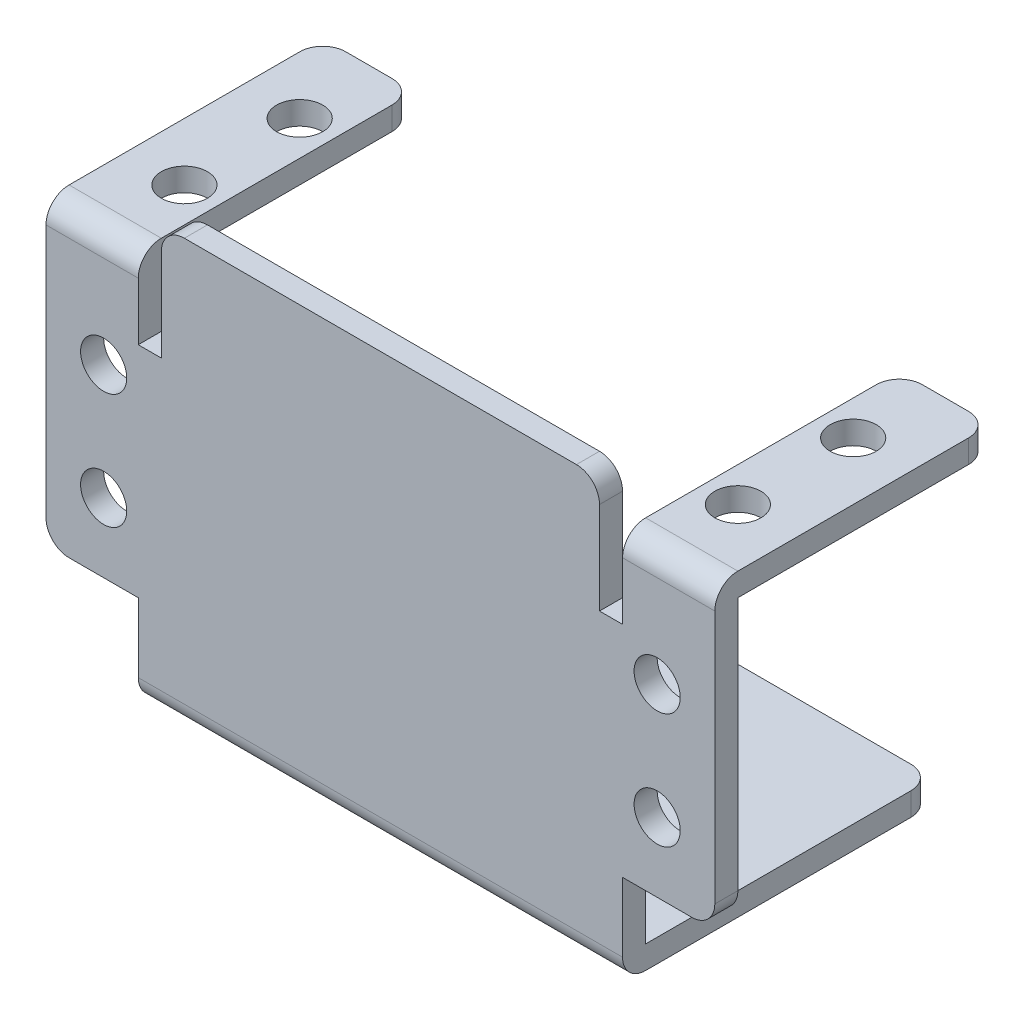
ISO-10303-21;
HEADER;
FILE_DESCRIPTION(('STEP AP214'),'2;1');
FILE_NAME('part.step','',(''),(''),'','','');
FILE_SCHEMA(('AUTOMOTIVE_DESIGN { 1 0 10303 214 1 1 1 1 }'));
ENDSEC;
DATA;
#1=APPLICATION_CONTEXT('core data for automotive mechanical design processes');
#2=APPLICATION_PROTOCOL_DEFINITION('international standard','automotive_design',2000,#1);
#3=PRODUCT_CONTEXT('',#1,'mechanical');
#4=PRODUCT('Part','Part','',(#3));
#5=PRODUCT_RELATED_PRODUCT_CATEGORY('part','',(#4));
#6=PRODUCT_DEFINITION_FORMATION('','',#4);
#7=PRODUCT_DEFINITION_CONTEXT('part definition',#1,'design');
#8=PRODUCT_DEFINITION('design','',#6,#7);
#9=PRODUCT_DEFINITION_SHAPE('','',#8);
#10=(LENGTH_UNIT() NAMED_UNIT(*) SI_UNIT(.MILLI.,.METRE.));
#11=(NAMED_UNIT(*) PLANE_ANGLE_UNIT() SI_UNIT($,.RADIAN.));
#12=(NAMED_UNIT(*) SI_UNIT($,.STERADIAN.) SOLID_ANGLE_UNIT());
#13=UNCERTAINTY_MEASURE_WITH_UNIT(LENGTH_MEASURE(1.E-05),#10,'distance_accuracy_value','');
#14=(GEOMETRIC_REPRESENTATION_CONTEXT(3) GLOBAL_UNCERTAINTY_ASSIGNED_CONTEXT((#13)) GLOBAL_UNIT_ASSIGNED_CONTEXT((#10,
#11,#12)) REPRESENTATION_CONTEXT('',''));
#15=CARTESIAN_POINT('',(0.,0.,0.));
#16=DIRECTION('',(0.,0.,1.));
#17=DIRECTION('',(1.,0.,0.));
#18=AXIS2_PLACEMENT_3D('',#15,#16,#17);
#19=CARTESIAN_POINT('',(-65.2513428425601,2.,-34.1860296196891));
#20=DIRECTION('',(1.,0.,0.));
#21=DIRECTION('',(0.,0.,-1.));
#22=AXIS2_PLACEMENT_3D('',#19,#20,#21);
#23=PLANE('',#22);
#24=DIRECTION('',(0.,0.,1.));
#25=VECTOR('',#24,1.);
#26=CARTESIAN_POINT('',(-65.2513428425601,2.,-34.1860296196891));
#27=LINE('',#26,#25);
#28=CARTESIAN_POINT('',(-65.2513428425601,2.,-32.1860296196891));
#29=VERTEX_POINT('',#28);
#30=CARTESIAN_POINT('',(-65.2513428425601,2.,-9.18602961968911));
#31=VERTEX_POINT('',#30);
#32=EDGE_CURVE('E341',#29,#31,#27,.T.);
#33=ORIENTED_EDGE('',*,*,#32,.F.);
#34=DIRECTION('',(0.,-1.,0.));
#35=VECTOR('',#34,1.);
#36=CARTESIAN_POINT('',(-65.2513428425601,2.,-32.1860296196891));
#37=LINE('',#36,#35);
#38=CARTESIAN_POINT('',(-65.2513428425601,0.,-32.1860296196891));
#39=VERTEX_POINT('',#38);
#40=EDGE_CURVE('E414',#29,#39,#37,.T.);
#41=ORIENTED_EDGE('',*,*,#40,.T.);
#42=DIRECTION('',(0.,0.,1.));
#43=VECTOR('',#42,1.);
#44=CARTESIAN_POINT('',(-65.2513428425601,0.,-34.1860296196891));
#45=LINE('',#44,#43);
#46=CARTESIAN_POINT('',(-65.2513428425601,0.,-9.18602961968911));
#47=VERTEX_POINT('',#46);
#48=EDGE_CURVE('E340',#39,#47,#45,.T.);
#49=ORIENTED_EDGE('',*,*,#48,.T.);
#50=CARTESIAN_POINT('',(-65.2513428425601,2.,-9.18602961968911));
#51=DIRECTION('',(1.,0.,0.));
#52=DIRECTION('',(0.,0.,-1.));
#53=AXIS2_PLACEMENT_3D('',#50,#51,#52);
#54=CIRCLE('',#53,2.);
#55=CARTESIAN_POINT('',(-65.2513428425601,2.,-7.18602961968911));
#56=VERTEX_POINT('',#55);
#57=EDGE_CURVE('E412',#47,#56,#54,.F.);
#58=ORIENTED_EDGE('',*,*,#57,.T.);
#59=DIRECTION('',(0.,-1.,0.));
#60=VECTOR('',#59,1.);
#61=CARTESIAN_POINT('',(-65.2513428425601,0.,-7.18602961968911));
#62=LINE('',#61,#60);
#63=CARTESIAN_POINT('',(-65.2513428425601,8.,-7.18602961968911));
#64=VERTEX_POINT('',#63);
#65=EDGE_CURVE('E326',#64,#56,#62,.T.);
#66=ORIENTED_EDGE('',*,*,#65,.F.);
#67=DIRECTION('',(0.,0.,-1.));
#68=VECTOR('',#67,1.);
#69=CARTESIAN_POINT('',(-65.2513428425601,8.,-7.18602961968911));
#70=LINE('',#69,#68);
#71=CARTESIAN_POINT('',(-65.2513428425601,8.,-9.18602961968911));
#72=VERTEX_POINT('',#71);
#73=EDGE_CURVE('E322',#64,#72,#70,.T.);
#74=ORIENTED_EDGE('',*,*,#73,.T.);
#75=DIRECTION('',(0.,-1.,0.));
#76=VECTOR('',#75,1.);
#77=CARTESIAN_POINT('',(-65.2513428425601,0.,-9.18602961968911));
#78=LINE('',#77,#76);
#79=EDGE_CURVE('E318',#72,#31,#78,.T.);
#80=ORIENTED_EDGE('',*,*,#79,.T.);
#81=EDGE_LOOP('',(#33,#41,#49,#58,#66,#74,#80));
#82=FACE_BOUND('',#81,.T.);
#83=ADVANCED_FACE('F34',(#82),#23,.F.);
#84=CARTESIAN_POINT('',(-23.2513428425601,2.,-34.1860296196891));
#85=DIRECTION('',(-1.,0.,0.));
#86=DIRECTION('',(0.,0.,1.));
#87=AXIS2_PLACEMENT_3D('',#84,#85,#86);
#88=PLANE('',#87);
#89=DIRECTION('',(0.,0.,-1.));
#90=VECTOR('',#89,1.);
#91=CARTESIAN_POINT('',(-23.2513428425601,0.,-34.1860296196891));
#92=LINE('',#91,#90);
#93=CARTESIAN_POINT('',(-23.2513428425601,0.,-9.18602961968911));
#94=VERTEX_POINT('',#93);
#95=CARTESIAN_POINT('',(-23.2513428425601,0.,-32.1860296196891));
#96=VERTEX_POINT('',#95);
#97=EDGE_CURVE('E356',#94,#96,#92,.T.);
#98=ORIENTED_EDGE('',*,*,#97,.T.);
#99=DIRECTION('',(0.,-1.,0.));
#100=VECTOR('',#99,1.);
#101=CARTESIAN_POINT('',(-23.2513428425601,2.,-32.1860296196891));
#102=LINE('',#101,#100);
#103=CARTESIAN_POINT('',(-23.2513428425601,2.,-32.1860296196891));
#104=VERTEX_POINT('',#103);
#105=EDGE_CURVE('E434',#96,#104,#102,.F.);
#106=ORIENTED_EDGE('',*,*,#105,.T.);
#107=DIRECTION('',(0.,0.,-1.));
#108=VECTOR('',#107,1.);
#109=CARTESIAN_POINT('',(-23.2513428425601,2.,-34.1860296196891));
#110=LINE('',#109,#108);
#111=CARTESIAN_POINT('',(-23.2513428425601,2.,-9.18602961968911));
#112=VERTEX_POINT('',#111);
#113=EDGE_CURVE('E347',#112,#104,#110,.T.);
#114=ORIENTED_EDGE('',*,*,#113,.F.);
#115=DIRECTION('',(0.,1.,0.));
#116=VECTOR('',#115,1.);
#117=CARTESIAN_POINT('',(-23.2513428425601,0.,-9.18602961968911));
#118=LINE('',#117,#116);
#119=CARTESIAN_POINT('',(-23.2513428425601,8.,-9.18602961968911));
#120=VERTEX_POINT('',#119);
#121=EDGE_CURVE('E484',#112,#120,#118,.T.);
#122=ORIENTED_EDGE('',*,*,#121,.T.);
#123=DIRECTION('',(0.,0.,-1.));
#124=VECTOR('',#123,1.);
#125=CARTESIAN_POINT('',(-23.2513428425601,8.,-7.18602961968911));
#126=LINE('',#125,#124);
#127=CARTESIAN_POINT('',(-23.2513428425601,8.,-7.18602961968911));
#128=VERTEX_POINT('',#127);
#129=EDGE_CURVE('E337',#128,#120,#126,.T.);
#130=ORIENTED_EDGE('',*,*,#129,.F.);
#131=DIRECTION('',(0.,1.,0.));
#132=VECTOR('',#131,1.);
#133=CARTESIAN_POINT('',(-23.2513428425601,0.,-7.18602961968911));
#134=LINE('',#133,#132);
#135=CARTESIAN_POINT('',(-23.2513428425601,2.,-7.18602961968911));
#136=VERTEX_POINT('',#135);
#137=EDGE_CURVE('E321',#136,#128,#134,.T.);
#138=ORIENTED_EDGE('',*,*,#137,.F.);
#139=CARTESIAN_POINT('',(-23.2513428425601,2.,-9.18602961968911));
#140=DIRECTION('',(-1.,0.,0.));
#141=DIRECTION('',(0.,0.,1.));
#142=AXIS2_PLACEMENT_3D('',#139,#140,#141);
#143=CIRCLE('',#142,2.);
#144=EDGE_CURVE('E432',#136,#94,#143,.F.);
#145=ORIENTED_EDGE('',*,*,#144,.T.);
#146=EDGE_LOOP('',(#98,#106,#114,#122,#130,#138,#145));
#147=FACE_BOUND('',#146,.T.);
#148=ADVANCED_FACE('F606',(#147),#88,.F.);
#149=CARTESIAN_POINT('',(-65.2513428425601,2.,-34.1860296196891));
#150=DIRECTION('',(0.,0.,1.));
#151=DIRECTION('',(1.,0.,0.));
#152=AXIS2_PLACEMENT_3D('',#149,#150,#151);
#153=PLANE('',#152);
#154=DIRECTION('',(-1.,0.,0.));
#155=VECTOR('',#154,1.);
#156=CARTESIAN_POINT('',(-65.2513428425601,0.,-34.1860296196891));
#157=LINE('',#156,#155);
#158=CARTESIAN_POINT('',(-25.2513428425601,0.,-34.1860296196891));
#159=VERTEX_POINT('',#158);
#160=CARTESIAN_POINT('',(-63.2513428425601,0.,-34.1860296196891));
#161=VERTEX_POINT('',#160);
#162=EDGE_CURVE('E344',#159,#161,#157,.T.);
#163=ORIENTED_EDGE('',*,*,#162,.T.);
#164=DIRECTION('',(0.,-1.,0.));
#165=VECTOR('',#164,1.);
#166=CARTESIAN_POINT('',(-63.2513428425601,2.,-34.1860296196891));
#167=LINE('',#166,#165);
#168=CARTESIAN_POINT('',(-63.2513428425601,2.,-34.1860296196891));
#169=VERTEX_POINT('',#168);
#170=EDGE_CURVE('E426',#161,#169,#167,.F.);
#171=ORIENTED_EDGE('',*,*,#170,.T.);
#172=DIRECTION('',(-1.,0.,0.));
#173=VECTOR('',#172,1.);
#174=CARTESIAN_POINT('',(-65.2513428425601,2.,-34.1860296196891));
#175=LINE('',#174,#173);
#176=CARTESIAN_POINT('',(-25.2513428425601,2.,-34.1860296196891));
#177=VERTEX_POINT('',#176);
#178=EDGE_CURVE('E350',#177,#169,#175,.T.);
#179=ORIENTED_EDGE('',*,*,#178,.F.);
#180=DIRECTION('',(0.,-1.,0.));
#181=VECTOR('',#180,1.);
#182=CARTESIAN_POINT('',(-25.2513428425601,2.,-34.1860296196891));
#183=LINE('',#182,#181);
#184=EDGE_CURVE('E423',#177,#159,#183,.T.);
#185=ORIENTED_EDGE('',*,*,#184,.T.);
#186=EDGE_LOOP('',(#163,#171,#179,#185));
#187=FACE_BOUND('',#186,.T.);
#188=ADVANCED_FACE('F618',(#187),#153,.F.);
#189=CARTESIAN_POINT('',(0.,2.,0.));
#190=DIRECTION('',(0.,1.,0.));
#191=DIRECTION('',(0.,0.,1.));
#192=AXIS2_PLACEMENT_3D('',#189,#190,#191);
#193=PLANE('',#192);
#194=ORIENTED_EDGE('',*,*,#178,.T.);
#195=CARTESIAN_POINT('',(-63.2513428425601,2.,-32.1860296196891));
#196=DIRECTION('',(0.,1.,0.));
#197=DIRECTION('',(0.,0.,1.));
#198=AXIS2_PLACEMENT_3D('',#195,#196,#197);
#199=CIRCLE('',#198,2.);
#200=EDGE_CURVE('E430',#169,#29,#199,.T.);
#201=ORIENTED_EDGE('',*,*,#200,.T.);
#202=ORIENTED_EDGE('',*,*,#32,.T.);
#203=DIRECTION('',(1.,0.,0.));
#204=VECTOR('',#203,1.);
#205=CARTESIAN_POINT('',(-65.2513428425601,2.,-9.18602961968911));
#206=LINE('',#205,#204);
#207=EDGE_CURVE('E343',#31,#112,#206,.T.);
#208=ORIENTED_EDGE('',*,*,#207,.T.);
#209=ORIENTED_EDGE('',*,*,#113,.T.);
#210=CARTESIAN_POINT('',(-25.2513428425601,2.,-32.1860296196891));
#211=DIRECTION('',(0.,1.,0.));
#212=DIRECTION('',(0.,0.,1.));
#213=AXIS2_PLACEMENT_3D('',#210,#211,#212);
#214=CIRCLE('',#213,2.);
#215=EDGE_CURVE('E428',#104,#177,#214,.T.);
#216=ORIENTED_EDGE('',*,*,#215,.T.);
#217=EDGE_LOOP('',(#194,#201,#202,#208,#209,#216));
#218=FACE_BOUND('',#217,.T.);
#219=ADVANCED_FACE('F622',(#218),#193,.T.);
#220=CARTESIAN_POINT('',(0.,0.,0.));
#221=DIRECTION('',(0.,1.,0.));
#222=DIRECTION('',(0.,0.,1.));
#223=AXIS2_PLACEMENT_3D('',#220,#221,#222);
#224=PLANE('',#223);
#225=ORIENTED_EDGE('',*,*,#48,.F.);
#226=CARTESIAN_POINT('',(-63.2513428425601,0.,-32.1860296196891));
#227=DIRECTION('',(0.,1.,0.));
#228=DIRECTION('',(0.,0.,1.));
#229=AXIS2_PLACEMENT_3D('',#226,#227,#228);
#230=CIRCLE('',#229,2.);
#231=EDGE_CURVE('E421',#39,#161,#230,.F.);
#232=ORIENTED_EDGE('',*,*,#231,.T.);
#233=ORIENTED_EDGE('',*,*,#162,.F.);
#234=CARTESIAN_POINT('',(-25.2513428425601,0.,-32.1860296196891));
#235=DIRECTION('',(0.,1.,0.));
#236=DIRECTION('',(0.,0.,1.));
#237=AXIS2_PLACEMENT_3D('',#234,#235,#236);
#238=CIRCLE('',#237,2.);
#239=EDGE_CURVE('E419',#159,#96,#238,.F.);
#240=ORIENTED_EDGE('',*,*,#239,.T.);
#241=ORIENTED_EDGE('',*,*,#97,.F.);
#242=DIRECTION('',(1.,0.,0.));
#243=VECTOR('',#242,1.);
#244=CARTESIAN_POINT('',(0.,0.,-9.18602961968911));
#245=LINE('',#244,#243);
#246=EDGE_CURVE('E417',#94,#47,#245,.F.);
#247=ORIENTED_EDGE('',*,*,#246,.T.);
#248=EDGE_LOOP('',(#225,#232,#233,#240,#241,#247));
#249=FACE_BOUND('',#248,.T.);
#250=ADVANCED_FACE('F610',(#249),#224,.F.);
#251=CARTESIAN_POINT('',(0.,0.,-9.18602961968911));
#252=DIRECTION('',(0.,0.,-1.));
#253=DIRECTION('',(-1.,0.,0.));
#254=AXIS2_PLACEMENT_3D('',#251,#252,#253);
#255=PLANE('',#254);
#256=CARTESIAN_POINT('',(-20.2513428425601,14.,-9.18602961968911));
#257=DIRECTION('',(0.,0.,-1.));
#258=DIRECTION('',(-1.,0.,0.));
#259=AXIS2_PLACEMENT_3D('',#256,#257,#258);
#260=CIRCLE('',#259,2.);
#261=CARTESIAN_POINT('',(-22.2513428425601,14.,-9.18602961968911));
#262=VERTEX_POINT('',#261);
#263=EDGE_CURVE('E937',#262,#262,#260,.T.);
#264=ORIENTED_EDGE('',*,*,#263,.F.);
#265=EDGE_LOOP('',(#264));
#266=FACE_BOUND('',#265,.T.);
#267=CARTESIAN_POINT('',(-68.2513428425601,24.,-9.18602961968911));
#268=DIRECTION('',(0.,0.,-1.));
#269=DIRECTION('',(-1.,0.,0.));
#270=AXIS2_PLACEMENT_3D('',#267,#268,#269);
#271=CIRCLE('',#270,2.);
#272=CARTESIAN_POINT('',(-70.2513428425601,24.,-9.18602961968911));
#273=VERTEX_POINT('',#272);
#274=EDGE_CURVE('E943',#273,#273,#271,.T.);
#275=ORIENTED_EDGE('',*,*,#274,.F.);
#276=EDGE_LOOP('',(#275));
#277=FACE_BOUND('',#276,.T.);
#278=CARTESIAN_POINT('',(-20.2513428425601,24.,-9.18602961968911));
#279=DIRECTION('',(0.,0.,-1.));
#280=DIRECTION('',(-1.,0.,0.));
#281=AXIS2_PLACEMENT_3D('',#278,#279,#280);
#282=CIRCLE('',#281,2.);
#283=CARTESIAN_POINT('',(-22.2513428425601,24.,-9.18602961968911));
#284=VERTEX_POINT('',#283);
#285=EDGE_CURVE('E951',#284,#284,#282,.T.);
#286=ORIENTED_EDGE('',*,*,#285,.F.);
#287=EDGE_LOOP('',(#286));
#288=FACE_BOUND('',#287,.T.);
#289=CARTESIAN_POINT('',(-68.2513428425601,14.,-9.18602961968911));
#290=DIRECTION('',(0.,0.,-1.));
#291=DIRECTION('',(-1.,0.,0.));
#292=AXIS2_PLACEMENT_3D('',#289,#290,#291);
#293=CIRCLE('',#292,2.);
#294=CARTESIAN_POINT('',(-70.2513428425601,14.,-9.18602961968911));
#295=VERTEX_POINT('',#294);
#296=EDGE_CURVE('E940',#295,#295,#293,.T.);
#297=ORIENTED_EDGE('',*,*,#296,.F.);
#298=EDGE_LOOP('',(#297));
#299=FACE_BOUND('',#298,.T.);
#300=DIRECTION('',(1.,0.,0.));
#301=VECTOR('',#300,1.);
#302=CARTESIAN_POINT('',(-65.2513428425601,8.,-9.18602961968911));
#303=LINE('',#302,#301);
#304=CARTESIAN_POINT('',(-71.2513428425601,8.,-9.18602961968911));
#305=VERTEX_POINT('',#304);
#306=EDGE_CURVE('E316',#305,#72,#303,.T.);
#307=ORIENTED_EDGE('',*,*,#306,.F.);
#308=CARTESIAN_POINT('',(-71.2513428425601,10.,-9.18602961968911));
#309=DIRECTION('',(0.,0.,-1.));
#310=DIRECTION('',(-1.,0.,0.));
#311=AXIS2_PLACEMENT_3D('',#308,#309,#310);
#312=CIRCLE('',#311,2.);
#313=CARTESIAN_POINT('',(-73.2513428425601,10.,-9.18602961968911));
#314=VERTEX_POINT('',#313);
#315=EDGE_CURVE('E369',#305,#314,#312,.T.);
#316=ORIENTED_EDGE('',*,*,#315,.T.);
#317=DIRECTION('',(0.,-1.,0.));
#318=VECTOR('',#317,1.);
#319=CARTESIAN_POINT('',(-73.2513428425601,8.,-9.18602961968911));
#320=LINE('',#319,#318);
#321=CARTESIAN_POINT('',(-73.2513428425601,32.,-9.18602961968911));
#322=VERTEX_POINT('',#321);
#323=EDGE_CURVE('E313',#322,#314,#320,.T.);
#324=ORIENTED_EDGE('',*,*,#323,.F.);
#325=DIRECTION('',(-1.,0.,0.));
#326=VECTOR('',#325,1.);
#327=CARTESIAN_POINT('',(-73.2513428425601,32.,-9.18602961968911));
#328=LINE('',#327,#326);
#329=CARTESIAN_POINT('',(-65.2513428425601,32.,-9.18602961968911));
#330=VERTEX_POINT('',#329);
#331=EDGE_CURVE('E310',#330,#322,#328,.T.);
#332=ORIENTED_EDGE('',*,*,#331,.F.);
#333=DIRECTION('',(0.,1.,0.));
#334=VECTOR('',#333,1.);
#335=CARTESIAN_POINT('',(-65.2513428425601,32.,-9.18602961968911));
#336=LINE('',#335,#334);
#337=CARTESIAN_POINT('',(-65.2513428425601,27.,-9.18602961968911));
#338=VERTEX_POINT('',#337);
#339=EDGE_CURVE('E307',#338,#330,#336,.T.);
#340=ORIENTED_EDGE('',*,*,#339,.F.);
#341=DIRECTION('',(-1.,0.,0.));
#342=VECTOR('',#341,1.);
#343=CARTESIAN_POINT('',(-65.2513428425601,27.,-9.18602961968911));
#344=LINE('',#343,#342);
#345=CARTESIAN_POINT('',(-63.2513428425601,27.,-9.18602961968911));
#346=VERTEX_POINT('',#345);
#347=EDGE_CURVE('E305',#346,#338,#344,.T.);
#348=ORIENTED_EDGE('',*,*,#347,.F.);
#349=DIRECTION('',(0.,-1.,0.));
#350=VECTOR('',#349,1.);
#351=CARTESIAN_POINT('',(-63.2513428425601,27.,-9.18602961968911));
#352=LINE('',#351,#350);
#353=CARTESIAN_POINT('',(-63.2513428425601,35.,-9.18602961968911));
#354=VERTEX_POINT('',#353);
#355=EDGE_CURVE('E303',#354,#346,#352,.T.);
#356=ORIENTED_EDGE('',*,*,#355,.F.);
#357=CARTESIAN_POINT('',(-61.2513428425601,35.,-9.18602961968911));
#358=DIRECTION('',(0.,0.,-1.));
#359=DIRECTION('',(-1.,0.,0.));
#360=AXIS2_PLACEMENT_3D('',#357,#358,#359);
#361=CIRCLE('',#360,2.);
#362=CARTESIAN_POINT('',(-61.2513428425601,37.,-9.18602961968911));
#363=VERTEX_POINT('',#362);
#364=EDGE_CURVE('E367',#354,#363,#361,.T.);
#365=ORIENTED_EDGE('',*,*,#364,.T.);
#366=DIRECTION('',(-1.,0.,0.));
#367=VECTOR('',#366,1.);
#368=CARTESIAN_POINT('',(-63.2513428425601,37.,-9.18602961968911));
#369=LINE('',#368,#367);
#370=CARTESIAN_POINT('',(-27.2513428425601,37.,-9.18602961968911));
#371=VERTEX_POINT('',#370);
#372=EDGE_CURVE('E300',#371,#363,#369,.T.);
#373=ORIENTED_EDGE('',*,*,#372,.F.);
#374=CARTESIAN_POINT('',(-27.2513428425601,35.,-9.18602961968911));
#375=DIRECTION('',(0.,0.,-1.));
#376=DIRECTION('',(-1.,0.,0.));
#377=AXIS2_PLACEMENT_3D('',#374,#375,#376);
#378=CIRCLE('',#377,2.);
#379=CARTESIAN_POINT('',(-25.2513428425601,35.,-9.18602961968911));
#380=VERTEX_POINT('',#379);
#381=EDGE_CURVE('E365',#371,#380,#378,.T.);
#382=ORIENTED_EDGE('',*,*,#381,.T.);
#383=DIRECTION('',(0.,1.,0.));
#384=VECTOR('',#383,1.);
#385=CARTESIAN_POINT('',(-25.2513428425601,27.,-9.18602961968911));
#386=LINE('',#385,#384);
#387=CARTESIAN_POINT('',(-25.2513428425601,27.,-9.18602961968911));
#388=VERTEX_POINT('',#387);
#389=EDGE_CURVE('E294',#388,#380,#386,.T.);
#390=ORIENTED_EDGE('',*,*,#389,.F.);
#391=DIRECTION('',(-1.,0.,0.));
#392=VECTOR('',#391,1.);
#393=CARTESIAN_POINT('',(-23.2513428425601,27.,-9.18602961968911));
#394=LINE('',#393,#392);
#395=CARTESIAN_POINT('',(-23.2513428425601,27.,-9.18602961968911));
#396=VERTEX_POINT('',#395);
#397=EDGE_CURVE('E292',#396,#388,#394,.T.);
#398=ORIENTED_EDGE('',*,*,#397,.F.);
#399=DIRECTION('',(0.,-1.,0.));
#400=VECTOR('',#399,1.);
#401=CARTESIAN_POINT('',(-23.2513428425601,32.,-9.18602961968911));
#402=LINE('',#401,#400);
#403=CARTESIAN_POINT('',(-23.2513428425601,32.,-9.18602961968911));
#404=VERTEX_POINT('',#403);
#405=EDGE_CURVE('E269',#404,#396,#402,.T.);
#406=ORIENTED_EDGE('',*,*,#405,.F.);
#407=DIRECTION('',(-1.,0.,0.));
#408=VECTOR('',#407,1.);
#409=CARTESIAN_POINT('',(-15.2513428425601,32.,-9.18602961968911));
#410=LINE('',#409,#408);
#411=CARTESIAN_POINT('',(-15.2513428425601,32.,-9.18602961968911));
#412=VERTEX_POINT('',#411);
#413=EDGE_CURVE('E279',#412,#404,#410,.T.);
#414=ORIENTED_EDGE('',*,*,#413,.F.);
#415=DIRECTION('',(0.,1.,0.));
#416=VECTOR('',#415,1.);
#417=CARTESIAN_POINT('',(-15.2513428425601,8.,-9.18602961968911));
#418=LINE('',#417,#416);
#419=CARTESIAN_POINT('',(-15.2513428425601,10.,-9.18602961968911));
#420=VERTEX_POINT('',#419);
#421=EDGE_CURVE('E286',#420,#412,#418,.T.);
#422=ORIENTED_EDGE('',*,*,#421,.F.);
#423=CARTESIAN_POINT('',(-17.2513428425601,10.,-9.18602961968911));
#424=DIRECTION('',(0.,0.,-1.));
#425=DIRECTION('',(-1.,0.,0.));
#426=AXIS2_PLACEMENT_3D('',#423,#424,#425);
#427=CIRCLE('',#426,2.);
#428=CARTESIAN_POINT('',(-17.2513428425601,8.,-9.18602961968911));
#429=VERTEX_POINT('',#428);
#430=EDGE_CURVE('E363',#420,#429,#427,.T.);
#431=ORIENTED_EDGE('',*,*,#430,.T.);
#432=DIRECTION('',(1.,0.,0.));
#433=VECTOR('',#432,1.);
#434=CARTESIAN_POINT('',(-23.2513428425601,8.,-9.18602961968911));
#435=LINE('',#434,#433);
#436=EDGE_CURVE('E535',#120,#429,#435,.T.);
#437=ORIENTED_EDGE('',*,*,#436,.F.);
#438=ORIENTED_EDGE('',*,*,#121,.F.);
#439=ORIENTED_EDGE('',*,*,#207,.F.);
#440=ORIENTED_EDGE('',*,*,#79,.F.);
#441=EDGE_LOOP('',(#307,#316,#324,#332,#340,#348,#356,#365,#373,#382,#390,#398,#406,#414,#422,
#431,#437,#438,#439,#440));
#442=FACE_BOUND('',#441,.T.);
#443=ADVANCED_FACE('F290',(#266,#277,#288,#299,#442),#255,.T.);
#444=CARTESIAN_POINT('',(-23.2513428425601,8.,-7.18602961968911));
#445=DIRECTION('',(0.,1.,0.));
#446=DIRECTION('',(0.,0.,1.));
#447=AXIS2_PLACEMENT_3D('',#444,#445,#446);
#448=PLANE('',#447);
#449=ORIENTED_EDGE('',*,*,#436,.T.);
#450=DIRECTION('',(0.,0.,-1.));
#451=VECTOR('',#450,1.);
#452=CARTESIAN_POINT('',(-17.2513428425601,8.,-7.18602961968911));
#453=LINE('',#452,#451);
#454=CARTESIAN_POINT('',(-17.2513428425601,8.,-7.18602961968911));
#455=VERTEX_POINT('',#454);
#456=EDGE_CURVE('E410',#429,#455,#453,.F.);
#457=ORIENTED_EDGE('',*,*,#456,.T.);
#458=DIRECTION('',(1.,0.,0.));
#459=VECTOR('',#458,1.);
#460=CARTESIAN_POINT('',(-23.2513428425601,8.,-7.18602961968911));
#461=LINE('',#460,#459);
#462=EDGE_CURVE('E504',#128,#455,#461,.T.);
#463=ORIENTED_EDGE('',*,*,#462,.F.);
#464=ORIENTED_EDGE('',*,*,#129,.T.);
#465=EDGE_LOOP('',(#449,#457,#463,#464));
#466=FACE_BOUND('',#465,.T.);
#467=ADVANCED_FACE('F546',(#466),#448,.F.);
#468=CARTESIAN_POINT('',(-15.2513428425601,8.,-7.18602961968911));
#469=DIRECTION('',(-1.,0.,0.));
#470=DIRECTION('',(0.,0.,1.));
#471=AXIS2_PLACEMENT_3D('',#468,#469,#470);
#472=PLANE('',#471);
#473=DIRECTION('',(0.,1.,0.));
#474=VECTOR('',#473,1.);
#475=CARTESIAN_POINT('',(-15.2513428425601,8.,-7.18602961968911));
#476=LINE('',#475,#474);
#477=CARTESIAN_POINT('',(-15.2513428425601,10.,-7.18602961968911));
#478=VERTEX_POINT('',#477);
#479=CARTESIAN_POINT('',(-15.2513428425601,32.,-7.18602961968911));
#480=VERTEX_POINT('',#479);
#481=EDGE_CURVE('E507',#478,#480,#476,.T.);
#482=ORIENTED_EDGE('',*,*,#481,.F.);
#483=DIRECTION('',(0.,0.,-1.));
#484=VECTOR('',#483,1.);
#485=CARTESIAN_POINT('',(-15.2513428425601,10.,-7.18602961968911));
#486=LINE('',#485,#484);
#487=EDGE_CURVE('E407',#478,#420,#486,.T.);
#488=ORIENTED_EDGE('',*,*,#487,.T.);
#489=ORIENTED_EDGE('',*,*,#421,.T.);
#490=DIRECTION('',(0.,0.,-1.));
#491=VECTOR('',#490,1.);
#492=CARTESIAN_POINT('',(-15.2513428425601,32.,-31.1860296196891));
#493=LINE('',#492,#491);
#494=CARTESIAN_POINT('',(-15.2513428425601,32.,-29.1860296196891));
#495=VERTEX_POINT('',#494);
#496=EDGE_CURVE('E283',#412,#495,#493,.T.);
#497=ORIENTED_EDGE('',*,*,#496,.T.);
#498=DIRECTION('',(0.,-1.,0.));
#499=VECTOR('',#498,1.);
#500=CARTESIAN_POINT('',(-15.2513428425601,8.,-29.1860296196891));
#501=LINE('',#500,#499);
#502=CARTESIAN_POINT('',(-15.2513428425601,34.,-29.1860296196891));
#503=VERTEX_POINT('',#502);
#504=EDGE_CURVE('E405',#495,#503,#501,.F.);
#505=ORIENTED_EDGE('',*,*,#504,.T.);
#506=DIRECTION('',(0.,0.,-1.));
#507=VECTOR('',#506,1.);
#508=CARTESIAN_POINT('',(-15.2513428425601,34.,-31.1860296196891));
#509=LINE('',#508,#507);
#510=CARTESIAN_POINT('',(-15.2513428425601,34.,-9.18602961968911));
#511=VERTEX_POINT('',#510);
#512=EDGE_CURVE('E274',#511,#503,#509,.T.);
#513=ORIENTED_EDGE('',*,*,#512,.F.);
#514=CARTESIAN_POINT('',(-15.2513428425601,32.,-9.18602961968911));
#515=DIRECTION('',(-1.,0.,0.));
#516=DIRECTION('',(0.,0.,1.));
#517=AXIS2_PLACEMENT_3D('',#514,#515,#516);
#518=CIRCLE('',#517,2.);
#519=EDGE_CURVE('E403',#511,#480,#518,.F.);
#520=ORIENTED_EDGE('',*,*,#519,.T.);
#521=EDGE_LOOP('',(#482,#488,#489,#497,#505,#513,#520));
#522=FACE_BOUND('',#521,.T.);
#523=ADVANCED_FACE('F539',(#522),#472,.F.);
#524=CARTESIAN_POINT('',(-23.2513428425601,32.,-7.18602961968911));
#525=DIRECTION('',(1.,0.,0.));
#526=DIRECTION('',(0.,0.,-1.));
#527=AXIS2_PLACEMENT_3D('',#524,#525,#526);
#528=PLANE('',#527);
#529=DIRECTION('',(0.,0.,1.));
#530=VECTOR('',#529,1.);
#531=CARTESIAN_POINT('',(-23.2513428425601,34.,-7.18602961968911));
#532=LINE('',#531,#530);
#533=CARTESIAN_POINT('',(-23.2513428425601,34.,-29.1860296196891));
#534=VERTEX_POINT('',#533);
#535=CARTESIAN_POINT('',(-23.2513428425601,34.,-9.18602961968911));
#536=VERTEX_POINT('',#535);
#537=EDGE_CURVE('E500',#534,#536,#532,.T.);
#538=ORIENTED_EDGE('',*,*,#537,.F.);
#539=DIRECTION('',(0.,-1.,0.));
#540=VECTOR('',#539,1.);
#541=CARTESIAN_POINT('',(-23.2513428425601,32.,-29.1860296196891));
#542=LINE('',#541,#540);
#543=CARTESIAN_POINT('',(-23.2513428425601,32.,-29.1860296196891));
#544=VERTEX_POINT('',#543);
#545=EDGE_CURVE('E272',#534,#544,#542,.T.);
#546=ORIENTED_EDGE('',*,*,#545,.T.);
#547=DIRECTION('',(0.,0.,1.));
#548=VECTOR('',#547,1.);
#549=CARTESIAN_POINT('',(-23.2513428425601,32.,-7.18602961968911));
#550=LINE('',#549,#548);
#551=EDGE_CURVE('E263',#544,#404,#550,.T.);
#552=ORIENTED_EDGE('',*,*,#551,.T.);
#553=ORIENTED_EDGE('',*,*,#405,.T.);
#554=DIRECTION('',(0.,0.,-1.));
#555=VECTOR('',#554,1.);
#556=CARTESIAN_POINT('',(-23.2513428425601,27.,-7.18602961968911));
#557=LINE('',#556,#555);
#558=CARTESIAN_POINT('',(-23.2513428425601,27.,-7.18602961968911));
#559=VERTEX_POINT('',#558);
#560=EDGE_CURVE('E335',#559,#396,#557,.T.);
#561=ORIENTED_EDGE('',*,*,#560,.F.);
#562=DIRECTION('',(0.,-1.,0.));
#563=VECTOR('',#562,1.);
#564=CARTESIAN_POINT('',(-23.2513428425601,32.,-7.18602961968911));
#565=LINE('',#564,#563);
#566=CARTESIAN_POINT('',(-23.2513428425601,32.,-7.18602961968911));
#567=VERTEX_POINT('',#566);
#568=EDGE_CURVE('E510',#567,#559,#565,.T.);
#569=ORIENTED_EDGE('',*,*,#568,.F.);
#570=CARTESIAN_POINT('',(-23.2513428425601,32.,-9.18602961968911));
#571=DIRECTION('',(1.,0.,0.));
#572=DIRECTION('',(0.,0.,-1.));
#573=AXIS2_PLACEMENT_3D('',#570,#571,#572);
#574=CIRCLE('',#573,2.);
#575=EDGE_CURVE('E452',#567,#536,#574,.F.);
#576=ORIENTED_EDGE('',*,*,#575,.T.);
#577=EDGE_LOOP('',(#538,#546,#552,#553,#561,#569,#576));
#578=FACE_BOUND('',#577,.T.);
#579=ADVANCED_FACE('F266',(#578),#528,.F.);
#580=CARTESIAN_POINT('',(-23.2513428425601,27.,-7.18602961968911));
#581=DIRECTION('',(0.,-1.,0.));
#582=DIRECTION('',(0.,0.,-1.));
#583=AXIS2_PLACEMENT_3D('',#580,#581,#582);
#584=PLANE('',#583);
#585=ORIENTED_EDGE('',*,*,#397,.T.);
#586=DIRECTION('',(0.,0.,-1.));
#587=VECTOR('',#586,1.);
#588=CARTESIAN_POINT('',(-25.2513428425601,27.,-7.18602961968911));
#589=LINE('',#588,#587);
#590=CARTESIAN_POINT('',(-25.2513428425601,27.,-7.18602961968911));
#591=VERTEX_POINT('',#590);
#592=EDGE_CURVE('E332',#591,#388,#589,.T.);
#593=ORIENTED_EDGE('',*,*,#592,.F.);
#594=DIRECTION('',(-1.,0.,0.));
#595=VECTOR('',#594,1.);
#596=CARTESIAN_POINT('',(-23.2513428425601,27.,-7.18602961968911));
#597=LINE('',#596,#595);
#598=EDGE_CURVE('E512',#559,#591,#597,.T.);
#599=ORIENTED_EDGE('',*,*,#598,.F.);
#600=ORIENTED_EDGE('',*,*,#560,.T.);
#601=EDGE_LOOP('',(#585,#593,#599,#600));
#602=FACE_BOUND('',#601,.T.);
#603=ADVANCED_FACE('F739',(#602),#584,.F.);
#604=CARTESIAN_POINT('',(-25.2513428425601,27.,-7.18602961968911));
#605=DIRECTION('',(-1.,0.,0.));
#606=DIRECTION('',(0.,0.,1.));
#607=AXIS2_PLACEMENT_3D('',#604,#605,#606);
#608=PLANE('',#607);
#609=ORIENTED_EDGE('',*,*,#389,.T.);
#610=DIRECTION('',(0.,0.,-1.));
#611=VECTOR('',#610,1.);
#612=CARTESIAN_POINT('',(-25.2513428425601,35.,-7.18602961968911));
#613=LINE('',#612,#611);
#614=CARTESIAN_POINT('',(-25.2513428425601,35.,-7.18602961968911));
#615=VERTEX_POINT('',#614);
#616=EDGE_CURVE('E401',#380,#615,#613,.F.);
#617=ORIENTED_EDGE('',*,*,#616,.T.);
#618=DIRECTION('',(0.,1.,0.));
#619=VECTOR('',#618,1.);
#620=CARTESIAN_POINT('',(-25.2513428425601,27.,-7.18602961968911));
#621=LINE('',#620,#619);
#622=EDGE_CURVE('E514',#591,#615,#621,.T.);
#623=ORIENTED_EDGE('',*,*,#622,.F.);
#624=ORIENTED_EDGE('',*,*,#592,.T.);
#625=EDGE_LOOP('',(#609,#617,#623,#624));
#626=FACE_BOUND('',#625,.T.);
#627=ADVANCED_FACE('F736',(#626),#608,.F.);
#628=CARTESIAN_POINT('',(-63.2513428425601,37.,-7.18602961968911));
#629=DIRECTION('',(0.,-1.,0.));
#630=DIRECTION('',(0.,0.,-1.));
#631=AXIS2_PLACEMENT_3D('',#628,#629,#630);
#632=PLANE('',#631);
#633=ORIENTED_EDGE('',*,*,#372,.T.);
#634=DIRECTION('',(0.,0.,-1.));
#635=VECTOR('',#634,1.);
#636=CARTESIAN_POINT('',(-61.2513428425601,37.,-7.18602961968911));
#637=LINE('',#636,#635);
#638=CARTESIAN_POINT('',(-61.2513428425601,37.,-7.18602961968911));
#639=VERTEX_POINT('',#638);
#640=EDGE_CURVE('E399',#363,#639,#637,.F.);
#641=ORIENTED_EDGE('',*,*,#640,.T.);
#642=DIRECTION('',(-1.,0.,0.));
#643=VECTOR('',#642,1.);
#644=CARTESIAN_POINT('',(-25.2513428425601,37.,-7.18602961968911));
#645=LINE('',#644,#643);
#646=CARTESIAN_POINT('',(-27.2513428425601,37.,-7.18602961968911));
#647=VERTEX_POINT('',#646);
#648=EDGE_CURVE('E517',#647,#639,#645,.T.);
#649=ORIENTED_EDGE('',*,*,#648,.F.);
#650=DIRECTION('',(0.,0.,-1.));
#651=VECTOR('',#650,1.);
#652=CARTESIAN_POINT('',(-27.2513428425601,37.,-7.18602961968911));
#653=LINE('',#652,#651);
#654=EDGE_CURVE('E396',#647,#371,#653,.T.);
#655=ORIENTED_EDGE('',*,*,#654,.T.);
#656=EDGE_LOOP('',(#633,#641,#649,#655));
#657=FACE_BOUND('',#656,.T.);
#658=ADVANCED_FACE('F663',(#657),#632,.F.);
#659=CARTESIAN_POINT('',(-63.2513428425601,27.,-7.18602961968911));
#660=DIRECTION('',(1.,0.,0.));
#661=DIRECTION('',(0.,0.,-1.));
#662=AXIS2_PLACEMENT_3D('',#659,#660,#661);
#663=PLANE('',#662);
#664=DIRECTION('',(0.,-1.,0.));
#665=VECTOR('',#664,1.);
#666=CARTESIAN_POINT('',(-63.2513428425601,27.,-7.18602961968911));
#667=LINE('',#666,#665);
#668=CARTESIAN_POINT('',(-63.2513428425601,35.,-7.18602961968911));
#669=VERTEX_POINT('',#668);
#670=CARTESIAN_POINT('',(-63.2513428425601,27.,-7.18602961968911));
#671=VERTEX_POINT('',#670);
#672=EDGE_CURVE('E520',#669,#671,#667,.T.);
#673=ORIENTED_EDGE('',*,*,#672,.F.);
#674=DIRECTION('',(0.,0.,-1.));
#675=VECTOR('',#674,1.);
#676=CARTESIAN_POINT('',(-63.2513428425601,35.,-7.18602961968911));
#677=LINE('',#676,#675);
#678=EDGE_CURVE('E393',#669,#354,#677,.T.);
#679=ORIENTED_EDGE('',*,*,#678,.T.);
#680=ORIENTED_EDGE('',*,*,#355,.T.);
#681=DIRECTION('',(0.,0.,-1.));
#682=VECTOR('',#681,1.);
#683=CARTESIAN_POINT('',(-63.2513428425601,27.,-7.18602961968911));
#684=LINE('',#683,#682);
#685=EDGE_CURVE('E329',#671,#346,#684,.T.);
#686=ORIENTED_EDGE('',*,*,#685,.F.);
#687=EDGE_LOOP('',(#673,#679,#680,#686));
#688=FACE_BOUND('',#687,.T.);
#689=ADVANCED_FACE('F670',(#688),#663,.F.);
#690=CARTESIAN_POINT('',(-65.2513428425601,27.,-7.18602961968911));
#691=DIRECTION('',(0.,-1.,0.));
#692=DIRECTION('',(0.,0.,-1.));
#693=AXIS2_PLACEMENT_3D('',#690,#691,#692);
#694=PLANE('',#693);
#695=ORIENTED_EDGE('',*,*,#347,.T.);
#696=DIRECTION('',(0.,0.,-1.));
#697=VECTOR('',#696,1.);
#698=CARTESIAN_POINT('',(-65.2513428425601,27.,-7.18602961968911));
#699=LINE('',#698,#697);
#700=CARTESIAN_POINT('',(-65.2513428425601,27.,-7.18602961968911));
#701=VERTEX_POINT('',#700);
#702=EDGE_CURVE('E325',#701,#338,#699,.T.);
#703=ORIENTED_EDGE('',*,*,#702,.F.);
#704=DIRECTION('',(-1.,0.,0.));
#705=VECTOR('',#704,1.);
#706=CARTESIAN_POINT('',(-65.2513428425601,27.,-7.18602961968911));
#707=LINE('',#706,#705);
#708=EDGE_CURVE('E522',#671,#701,#707,.T.);
#709=ORIENTED_EDGE('',*,*,#708,.F.);
#710=ORIENTED_EDGE('',*,*,#685,.T.);
#711=EDGE_LOOP('',(#695,#703,#709,#710));
#712=FACE_BOUND('',#711,.T.);
#713=ADVANCED_FACE('F674',(#712),#694,.F.);
#714=CARTESIAN_POINT('',(-65.2513428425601,32.,-7.18602961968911));
#715=DIRECTION('',(-1.,0.,0.));
#716=DIRECTION('',(0.,0.,1.));
#717=AXIS2_PLACEMENT_3D('',#714,#715,#716);
#718=PLANE('',#717);
#719=DIRECTION('',(0.,0.,-1.));
#720=VECTOR('',#719,1.);
#721=CARTESIAN_POINT('',(-65.2513428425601,32.,-31.1860296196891));
#722=LINE('',#721,#720);
#723=CARTESIAN_POINT('',(-65.2513428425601,32.,-29.1860296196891));
#724=VERTEX_POINT('',#723);
#725=EDGE_CURVE('E496',#330,#724,#722,.T.);
#726=ORIENTED_EDGE('',*,*,#725,.T.);
#727=DIRECTION('',(0.,-1.,0.));
#728=VECTOR('',#727,1.);
#729=CARTESIAN_POINT('',(-65.2513428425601,32.,-29.1860296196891));
#730=LINE('',#729,#728);
#731=CARTESIAN_POINT('',(-65.2513428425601,34.,-29.1860296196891));
#732=VERTEX_POINT('',#731);
#733=EDGE_CURVE('E49',#724,#732,#730,.F.);
#734=ORIENTED_EDGE('',*,*,#733,.T.);
#735=DIRECTION('',(0.,0.,-1.));
#736=VECTOR('',#735,1.);
#737=CARTESIAN_POINT('',(-65.2513428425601,34.,-31.1860296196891));
#738=LINE('',#737,#736);
#739=CARTESIAN_POINT('',(-65.2513428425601,34.,-9.18602961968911));
#740=VERTEX_POINT('',#739);
#741=EDGE_CURVE('E498',#740,#732,#738,.T.);
#742=ORIENTED_EDGE('',*,*,#741,.F.);
#743=CARTESIAN_POINT('',(-65.2513428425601,32.,-9.18602961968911));
#744=DIRECTION('',(-1.,0.,0.));
#745=DIRECTION('',(0.,0.,1.));
#746=AXIS2_PLACEMENT_3D('',#743,#744,#745);
#747=CIRCLE('',#746,2.);
#748=CARTESIAN_POINT('',(-65.2513428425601,32.,-7.18602961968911));
#749=VERTEX_POINT('',#748);
#750=EDGE_CURVE('E57',#740,#749,#747,.F.);
#751=ORIENTED_EDGE('',*,*,#750,.T.);
#752=DIRECTION('',(0.,1.,0.));
#753=VECTOR('',#752,1.);
#754=CARTESIAN_POINT('',(-65.2513428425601,32.,-7.18602961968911));
#755=LINE('',#754,#753);
#756=EDGE_CURVE('E524',#701,#749,#755,.T.);
#757=ORIENTED_EDGE('',*,*,#756,.F.);
#758=ORIENTED_EDGE('',*,*,#702,.T.);
#759=ORIENTED_EDGE('',*,*,#339,.T.);
#760=EDGE_LOOP('',(#726,#734,#742,#751,#757,#758,#759));
#761=FACE_BOUND('',#760,.T.);
#762=ADVANCED_FACE('F579',(#761),#718,.F.);
#763=CARTESIAN_POINT('',(-73.2513428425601,8.,-7.18602961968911));
#764=DIRECTION('',(1.,0.,0.));
#765=DIRECTION('',(0.,0.,-1.));
#766=AXIS2_PLACEMENT_3D('',#763,#764,#765);
#767=PLANE('',#766);
#768=ORIENTED_EDGE('',*,*,#323,.T.);
#769=DIRECTION('',(0.,0.,-1.));
#770=VECTOR('',#769,1.);
#771=CARTESIAN_POINT('',(-73.2513428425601,10.,-7.18602961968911));
#772=LINE('',#771,#770);
#773=CARTESIAN_POINT('',(-73.2513428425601,10.,-7.18602961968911));
#774=VERTEX_POINT('',#773);
#775=EDGE_CURVE('E376',#314,#774,#772,.F.);
#776=ORIENTED_EDGE('',*,*,#775,.T.);
#777=DIRECTION('',(0.,-1.,0.));
#778=VECTOR('',#777,1.);
#779=CARTESIAN_POINT('',(-73.2513428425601,8.,-7.18602961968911));
#780=LINE('',#779,#778);
#781=CARTESIAN_POINT('',(-73.2513428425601,32.,-7.18602961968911));
#782=VERTEX_POINT('',#781);
#783=EDGE_CURVE('E527',#782,#774,#780,.T.);
#784=ORIENTED_EDGE('',*,*,#783,.F.);
#785=CARTESIAN_POINT('',(-73.2513428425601,32.,-9.18602961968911));
#786=DIRECTION('',(1.,0.,0.));
#787=DIRECTION('',(0.,0.,-1.));
#788=AXIS2_PLACEMENT_3D('',#785,#786,#787);
#789=CIRCLE('',#788,2.);
#790=CARTESIAN_POINT('',(-73.2513428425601,34.,-9.18602961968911));
#791=VERTEX_POINT('',#790);
#792=EDGE_CURVE('E371',#782,#791,#789,.F.);
#793=ORIENTED_EDGE('',*,*,#792,.T.);
#794=DIRECTION('',(0.,0.,1.));
#795=VECTOR('',#794,1.);
#796=CARTESIAN_POINT('',(-73.2513428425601,34.,-7.18602961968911));
#797=LINE('',#796,#795);
#798=CARTESIAN_POINT('',(-73.2513428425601,34.,-29.1860296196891));
#799=VERTEX_POINT('',#798);
#800=EDGE_CURVE('E473',#799,#791,#797,.T.);
#801=ORIENTED_EDGE('',*,*,#800,.F.);
#802=DIRECTION('',(0.,-1.,0.));
#803=VECTOR('',#802,1.);
#804=CARTESIAN_POINT('',(-73.2513428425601,8.,-29.1860296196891));
#805=LINE('',#804,#803);
#806=CARTESIAN_POINT('',(-73.2513428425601,32.,-29.1860296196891));
#807=VERTEX_POINT('',#806);
#808=EDGE_CURVE('E373',#799,#807,#805,.T.);
#809=ORIENTED_EDGE('',*,*,#808,.T.);
#810=DIRECTION('',(0.,0.,1.));
#811=VECTOR('',#810,1.);
#812=CARTESIAN_POINT('',(-73.2513428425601,32.,-7.18602961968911));
#813=LINE('',#812,#811);
#814=EDGE_CURVE('E492',#807,#322,#813,.T.);
#815=ORIENTED_EDGE('',*,*,#814,.T.);
#816=EDGE_LOOP('',(#768,#776,#784,#793,#801,#809,#815));
#817=FACE_BOUND('',#816,.T.);
#818=ADVANCED_FACE('F480',(#817),#767,.F.);
#819=CARTESIAN_POINT('',(-65.2513428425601,8.,-7.18602961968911));
#820=DIRECTION('',(0.,1.,0.));
#821=DIRECTION('',(0.,0.,1.));
#822=AXIS2_PLACEMENT_3D('',#819,#820,#821);
#823=PLANE('',#822);
#824=DIRECTION('',(1.,0.,0.));
#825=VECTOR('',#824,1.);
#826=CARTESIAN_POINT('',(-65.2513428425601,8.,-7.18602961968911));
#827=LINE('',#826,#825);
#828=CARTESIAN_POINT('',(-71.2513428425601,8.,-7.18602961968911));
#829=VERTEX_POINT('',#828);
#830=EDGE_CURVE('E530',#829,#64,#827,.T.);
#831=ORIENTED_EDGE('',*,*,#830,.F.);
#832=DIRECTION('',(0.,0.,-1.));
#833=VECTOR('',#832,1.);
#834=CARTESIAN_POINT('',(-71.2513428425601,8.,-7.18602961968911));
#835=LINE('',#834,#833);
#836=EDGE_CURVE('E353',#829,#305,#835,.T.);
#837=ORIENTED_EDGE('',*,*,#836,.T.);
#838=ORIENTED_EDGE('',*,*,#306,.T.);
#839=ORIENTED_EDGE('',*,*,#73,.F.);
#840=EDGE_LOOP('',(#831,#837,#838,#839));
#841=FACE_BOUND('',#840,.T.);
#842=ADVANCED_FACE('F594',(#841),#823,.F.);
#843=CARTESIAN_POINT('',(0.,0.,-7.18602961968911));
#844=DIRECTION('',(0.,0.,-1.));
#845=DIRECTION('',(-1.,0.,0.));
#846=AXIS2_PLACEMENT_3D('',#843,#844,#845);
#847=PLANE('',#846);
#848=CARTESIAN_POINT('',(-20.2513428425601,14.,-7.18602961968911));
#849=DIRECTION('',(0.,0.,-1.));
#850=DIRECTION('',(-1.,0.,0.));
#851=AXIS2_PLACEMENT_3D('',#848,#849,#850);
#852=CIRCLE('',#851,2.);
#853=CARTESIAN_POINT('',(-22.2513428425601,14.,-7.18602961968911));
#854=VERTEX_POINT('',#853);
#855=EDGE_CURVE('E934',#854,#854,#852,.T.);
#856=ORIENTED_EDGE('',*,*,#855,.T.);
#857=EDGE_LOOP('',(#856));
#858=FACE_BOUND('',#857,.T.);
#859=CARTESIAN_POINT('',(-68.2513428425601,24.,-7.18602961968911));
#860=DIRECTION('',(0.,0.,-1.));
#861=DIRECTION('',(-1.,0.,0.));
#862=AXIS2_PLACEMENT_3D('',#859,#860,#861);
#863=CIRCLE('',#862,2.);
#864=CARTESIAN_POINT('',(-70.2513428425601,24.,-7.18602961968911));
#865=VERTEX_POINT('',#864);
#866=EDGE_CURVE('E938',#865,#865,#863,.T.);
#867=ORIENTED_EDGE('',*,*,#866,.T.);
#868=EDGE_LOOP('',(#867));
#869=FACE_BOUND('',#868,.T.);
#870=CARTESIAN_POINT('',(-20.2513428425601,24.,-7.18602961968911));
#871=DIRECTION('',(0.,0.,-1.));
#872=DIRECTION('',(-1.,0.,0.));
#873=AXIS2_PLACEMENT_3D('',#870,#871,#872);
#874=CIRCLE('',#873,2.);
#875=CARTESIAN_POINT('',(-22.2513428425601,24.,-7.18602961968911));
#876=VERTEX_POINT('',#875);
#877=EDGE_CURVE('E948',#876,#876,#874,.T.);
#878=ORIENTED_EDGE('',*,*,#877,.T.);
#879=EDGE_LOOP('',(#878));
#880=FACE_BOUND('',#879,.T.);
#881=CARTESIAN_POINT('',(-68.2513428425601,14.,-7.18602961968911));
#882=DIRECTION('',(0.,0.,-1.));
#883=DIRECTION('',(-1.,0.,0.));
#884=AXIS2_PLACEMENT_3D('',#881,#882,#883);
#885=CIRCLE('',#884,2.);
#886=CARTESIAN_POINT('',(-70.2513428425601,14.,-7.18602961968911));
#887=VERTEX_POINT('',#886);
#888=EDGE_CURVE('E954',#887,#887,#885,.T.);
#889=ORIENTED_EDGE('',*,*,#888,.T.);
#890=EDGE_LOOP('',(#889));
#891=FACE_BOUND('',#890,.T.);
#892=ORIENTED_EDGE('',*,*,#783,.T.);
#893=CARTESIAN_POINT('',(-71.2513428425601,10.,-7.18602961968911));
#894=DIRECTION('',(0.,0.,-1.));
#895=DIRECTION('',(-1.,0.,0.));
#896=AXIS2_PLACEMENT_3D('',#893,#894,#895);
#897=CIRCLE('',#896,2.);
#898=EDGE_CURVE('E391',#774,#829,#897,.F.);
#899=ORIENTED_EDGE('',*,*,#898,.T.);
#900=ORIENTED_EDGE('',*,*,#830,.T.);
#901=ORIENTED_EDGE('',*,*,#65,.T.);
#902=DIRECTION('',(1.,0.,0.));
#903=VECTOR('',#902,1.);
#904=CARTESIAN_POINT('',(0.,2.,-7.18602961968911));
#905=LINE('',#904,#903);
#906=EDGE_CURVE('E378',#56,#136,#905,.T.);
#907=ORIENTED_EDGE('',*,*,#906,.T.);
#908=ORIENTED_EDGE('',*,*,#137,.T.);
#909=ORIENTED_EDGE('',*,*,#462,.T.);
#910=CARTESIAN_POINT('',(-17.2513428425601,10.,-7.18602961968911));
#911=DIRECTION('',(0.,0.,-1.));
#912=DIRECTION('',(-1.,0.,0.));
#913=AXIS2_PLACEMENT_3D('',#910,#911,#912);
#914=CIRCLE('',#913,2.);
#915=EDGE_CURVE('E385',#455,#478,#914,.F.);
#916=ORIENTED_EDGE('',*,*,#915,.T.);
#917=ORIENTED_EDGE('',*,*,#481,.T.);
#918=DIRECTION('',(1.,0.,0.));
#919=VECTOR('',#918,1.);
#920=CARTESIAN_POINT('',(0.,32.,-7.18602961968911));
#921=LINE('',#920,#919);
#922=EDGE_CURVE('E383',#480,#567,#921,.F.);
#923=ORIENTED_EDGE('',*,*,#922,.T.);
#924=ORIENTED_EDGE('',*,*,#568,.T.);
#925=ORIENTED_EDGE('',*,*,#598,.T.);
#926=ORIENTED_EDGE('',*,*,#622,.T.);
#927=CARTESIAN_POINT('',(-27.2513428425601,35.,-7.18602961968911));
#928=DIRECTION('',(0.,0.,-1.));
#929=DIRECTION('',(-1.,0.,0.));
#930=AXIS2_PLACEMENT_3D('',#927,#928,#929);
#931=CIRCLE('',#930,2.);
#932=EDGE_CURVE('E387',#615,#647,#931,.F.);
#933=ORIENTED_EDGE('',*,*,#932,.T.);
#934=ORIENTED_EDGE('',*,*,#648,.T.);
#935=CARTESIAN_POINT('',(-61.2513428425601,35.,-7.18602961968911));
#936=DIRECTION('',(0.,0.,-1.));
#937=DIRECTION('',(-1.,0.,0.));
#938=AXIS2_PLACEMENT_3D('',#935,#936,#937);
#939=CIRCLE('',#938,2.);
#940=EDGE_CURVE('E389',#639,#669,#939,.F.);
#941=ORIENTED_EDGE('',*,*,#940,.T.);
#942=ORIENTED_EDGE('',*,*,#672,.T.);
#943=ORIENTED_EDGE('',*,*,#708,.T.);
#944=ORIENTED_EDGE('',*,*,#756,.T.);
#945=DIRECTION('',(1.,0.,0.));
#946=VECTOR('',#945,1.);
#947=CARTESIAN_POINT('',(0.,32.,-7.18602961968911));
#948=LINE('',#947,#946);
#949=EDGE_CURVE('E381',#749,#782,#948,.F.);
#950=ORIENTED_EDGE('',*,*,#949,.T.);
#951=EDGE_LOOP('',(#892,#899,#900,#901,#907,#908,#909,#916,#917,#923,#924,#925,#926,#933,#934,
#941,#942,#943,#944,#950));
#952=FACE_BOUND('',#951,.T.);
#953=ADVANCED_FACE('F552',(#858,#869,#880,#891,#952),#847,.F.);
#954=CARTESIAN_POINT('',(-73.2513428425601,34.,-31.1860296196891));
#955=DIRECTION('',(0.,0.,1.));
#956=DIRECTION('',(1.,0.,0.));
#957=AXIS2_PLACEMENT_3D('',#954,#955,#956);
#958=PLANE('',#957);
#959=DIRECTION('',(-1.,0.,0.));
#960=VECTOR('',#959,1.);
#961=CARTESIAN_POINT('',(-73.2513428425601,34.,-31.1860296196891));
#962=LINE('',#961,#960);
#963=CARTESIAN_POINT('',(-67.2513428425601,34.,-31.1860296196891));
#964=VERTEX_POINT('',#963);
#965=CARTESIAN_POINT('',(-71.2513428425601,34.,-31.1860296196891));
#966=VERTEX_POINT('',#965);
#967=EDGE_CURVE('E475',#964,#966,#962,.T.);
#968=ORIENTED_EDGE('',*,*,#967,.F.);
#969=DIRECTION('',(0.,-1.,0.));
#970=VECTOR('',#969,1.);
#971=CARTESIAN_POINT('',(-67.2513428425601,34.,-31.1860296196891));
#972=LINE('',#971,#970);
#973=CARTESIAN_POINT('',(-67.2513428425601,32.,-31.1860296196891));
#974=VERTEX_POINT('',#973);
#975=EDGE_CURVE('E457',#964,#974,#972,.T.);
#976=ORIENTED_EDGE('',*,*,#975,.T.);
#977=DIRECTION('',(-1.,0.,0.));
#978=VECTOR('',#977,1.);
#979=CARTESIAN_POINT('',(-73.2513428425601,32.,-31.1860296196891));
#980=LINE('',#979,#978);
#981=CARTESIAN_POINT('',(-71.2513428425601,32.,-31.1860296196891));
#982=VERTEX_POINT('',#981);
#983=EDGE_CURVE('E491',#974,#982,#980,.T.);
#984=ORIENTED_EDGE('',*,*,#983,.T.);
#985=DIRECTION('',(0.,-1.,0.));
#986=VECTOR('',#985,1.);
#987=CARTESIAN_POINT('',(-71.2513428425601,34.,-31.1860296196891));
#988=LINE('',#987,#986);
#989=EDGE_CURVE('E455',#982,#966,#988,.F.);
#990=ORIENTED_EDGE('',*,*,#989,.T.);
#991=EDGE_LOOP('',(#968,#976,#984,#990));
#992=FACE_BOUND('',#991,.T.);
#993=ADVANCED_FACE('F494',(#992),#958,.F.);
#994=CARTESIAN_POINT('',(0.,34.,0.));
#995=DIRECTION('',(0.,-1.,0.));
#996=DIRECTION('',(0.,0.,-1.));
#997=AXIS2_PLACEMENT_3D('',#994,#995,#996);
#998=PLANE('',#997);
#999=CARTESIAN_POINT('',(-68.25134284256,34.,-14.1860296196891));
#1000=DIRECTION('',(0.,1.,0.));
#1001=DIRECTION('',(0.,0.,1.));
#1002=AXIS2_PLACEMENT_3D('',#999,#1000,#1001);
#1003=CIRCLE('',#1002,2.);
#1004=CARTESIAN_POINT('',(-68.25134284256,34.,-12.1860296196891));
#1005=VERTEX_POINT('',#1004);
#1006=EDGE_CURVE('E970',#1005,#1005,#1003,.T.);
#1007=ORIENTED_EDGE('',*,*,#1006,.F.);
#1008=EDGE_LOOP('',(#1007));
#1009=FACE_BOUND('',#1008,.T.);
#1010=CARTESIAN_POINT('',(-68.2513428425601,34.,-24.1860296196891));
#1011=DIRECTION('',(0.,1.,0.));
#1012=DIRECTION('',(0.,0.,1.));
#1013=AXIS2_PLACEMENT_3D('',#1010,#1011,#1012);
#1014=CIRCLE('',#1013,2.);
#1015=CARTESIAN_POINT('',(-68.2513428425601,34.,-22.1860296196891));
#1016=VERTEX_POINT('',#1015);
#1017=EDGE_CURVE('E963',#1016,#1016,#1014,.T.);
#1018=ORIENTED_EDGE('',*,*,#1017,.F.);
#1019=EDGE_LOOP('',(#1018));
#1020=FACE_BOUND('',#1019,.T.);
#1021=ORIENTED_EDGE('',*,*,#741,.T.);
#1022=CARTESIAN_POINT('',(-67.2513428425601,34.,-29.1860296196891));
#1023=DIRECTION('',(0.,-1.,0.));
#1024=DIRECTION('',(0.,0.,-1.));
#1025=AXIS2_PLACEMENT_3D('',#1022,#1023,#1024);
#1026=CIRCLE('',#1025,2.);
#1027=EDGE_CURVE('E11',#732,#964,#1026,.F.);
#1028=ORIENTED_EDGE('',*,*,#1027,.T.);
#1029=ORIENTED_EDGE('',*,*,#967,.T.);
#1030=CARTESIAN_POINT('',(-71.2513428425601,34.,-29.1860296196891));
#1031=DIRECTION('',(0.,-1.,0.));
#1032=DIRECTION('',(0.,0.,-1.));
#1033=AXIS2_PLACEMENT_3D('',#1030,#1031,#1032);
#1034=CIRCLE('',#1033,2.);
#1035=EDGE_CURVE('E42',#966,#799,#1034,.F.);
#1036=ORIENTED_EDGE('',*,*,#1035,.T.);
#1037=ORIENTED_EDGE('',*,*,#800,.T.);
#1038=DIRECTION('',(1.,0.,0.));
#1039=VECTOR('',#1038,1.);
#1040=CARTESIAN_POINT('',(0.,34.,-9.18602961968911));
#1041=LINE('',#1040,#1039);
#1042=EDGE_CURVE('E466',#791,#740,#1041,.T.);
#1043=ORIENTED_EDGE('',*,*,#1042,.T.);
#1044=EDGE_LOOP('',(#1021,#1028,#1029,#1036,#1037,#1043));
#1045=FACE_BOUND('',#1044,.T.);
#1046=ADVANCED_FACE('F472',(#1009,#1020,#1045),#998,.F.);
#1047=CARTESIAN_POINT('',(0.,32.,0.));
#1048=DIRECTION('',(0.,-1.,0.));
#1049=DIRECTION('',(0.,0.,-1.));
#1050=AXIS2_PLACEMENT_3D('',#1047,#1048,#1049);
#1051=PLANE('',#1050);
#1052=CARTESIAN_POINT('',(-68.25134284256,32.,-14.1860296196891));
#1053=DIRECTION('',(0.,1.,0.));
#1054=DIRECTION('',(0.,0.,1.));
#1055=AXIS2_PLACEMENT_3D('',#1052,#1053,#1054);
#1056=CIRCLE('',#1055,2.);
#1057=CARTESIAN_POINT('',(-68.25134284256,32.,-12.1860296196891));
#1058=VERTEX_POINT('',#1057);
#1059=EDGE_CURVE('E967',#1058,#1058,#1056,.T.);
#1060=ORIENTED_EDGE('',*,*,#1059,.T.);
#1061=EDGE_LOOP('',(#1060));
#1062=FACE_BOUND('',#1061,.T.);
#1063=CARTESIAN_POINT('',(-68.2513428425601,32.,-24.1860296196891));
#1064=DIRECTION('',(0.,1.,0.));
#1065=DIRECTION('',(0.,0.,1.));
#1066=AXIS2_PLACEMENT_3D('',#1063,#1064,#1065);
#1067=CIRCLE('',#1066,2.);
#1068=CARTESIAN_POINT('',(-68.2513428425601,32.,-22.1860296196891));
#1069=VERTEX_POINT('',#1068);
#1070=EDGE_CURVE('E572',#1069,#1069,#1067,.T.);
#1071=ORIENTED_EDGE('',*,*,#1070,.T.);
#1072=EDGE_LOOP('',(#1071));
#1073=FACE_BOUND('',#1072,.T.);
#1074=ORIENTED_EDGE('',*,*,#983,.F.);
#1075=CARTESIAN_POINT('',(-67.2513428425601,32.,-29.1860296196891));
#1076=DIRECTION('',(0.,-1.,0.));
#1077=DIRECTION('',(0.,0.,-1.));
#1078=AXIS2_PLACEMENT_3D('',#1075,#1076,#1077);
#1079=CIRCLE('',#1078,2.);
#1080=EDGE_CURVE('E462',#974,#724,#1079,.T.);
#1081=ORIENTED_EDGE('',*,*,#1080,.T.);
#1082=ORIENTED_EDGE('',*,*,#725,.F.);
#1083=ORIENTED_EDGE('',*,*,#331,.T.);
#1084=ORIENTED_EDGE('',*,*,#814,.F.);
#1085=CARTESIAN_POINT('',(-71.2513428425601,32.,-29.1860296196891));
#1086=DIRECTION('',(0.,-1.,0.));
#1087=DIRECTION('',(0.,0.,-1.));
#1088=AXIS2_PLACEMENT_3D('',#1085,#1086,#1087);
#1089=CIRCLE('',#1088,2.);
#1090=EDGE_CURVE('E460',#807,#982,#1089,.T.);
#1091=ORIENTED_EDGE('',*,*,#1090,.T.);
#1092=EDGE_LOOP('',(#1074,#1081,#1082,#1083,#1084,#1091));
#1093=FACE_BOUND('',#1092,.T.);
#1094=ADVANCED_FACE('F490',(#1062,#1073,#1093),#1051,.T.);
#1095=CARTESIAN_POINT('',(-23.2513428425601,34.,-31.1860296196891));
#1096=DIRECTION('',(0.,0.,1.));
#1097=DIRECTION('',(1.,0.,0.));
#1098=AXIS2_PLACEMENT_3D('',#1095,#1096,#1097);
#1099=PLANE('',#1098);
#1100=DIRECTION('',(-1.,0.,0.));
#1101=VECTOR('',#1100,1.);
#1102=CARTESIAN_POINT('',(-23.2513428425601,34.,-31.1860296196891));
#1103=LINE('',#1102,#1101);
#1104=CARTESIAN_POINT('',(-17.2513428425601,34.,-31.1860296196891));
#1105=VERTEX_POINT('',#1104);
#1106=CARTESIAN_POINT('',(-21.2513428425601,34.,-31.1860296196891));
#1107=VERTEX_POINT('',#1106);
#1108=EDGE_CURVE('E566',#1105,#1107,#1103,.T.);
#1109=ORIENTED_EDGE('',*,*,#1108,.F.);
#1110=DIRECTION('',(0.,-1.,0.));
#1111=VECTOR('',#1110,1.);
#1112=CARTESIAN_POINT('',(-17.2513428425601,34.,-31.1860296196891));
#1113=LINE('',#1112,#1111);
#1114=CARTESIAN_POINT('',(-17.2513428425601,32.,-31.1860296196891));
#1115=VERTEX_POINT('',#1114);
#1116=EDGE_CURVE('E438',#1105,#1115,#1113,.T.);
#1117=ORIENTED_EDGE('',*,*,#1116,.T.);
#1118=DIRECTION('',(-1.,0.,0.));
#1119=VECTOR('',#1118,1.);
#1120=CARTESIAN_POINT('',(-23.2513428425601,32.,-31.1860296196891));
#1121=LINE('',#1120,#1119);
#1122=CARTESIAN_POINT('',(-21.2513428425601,32.,-31.1860296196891));
#1123=VERTEX_POINT('',#1122);
#1124=EDGE_CURVE('E275',#1115,#1123,#1121,.T.);
#1125=ORIENTED_EDGE('',*,*,#1124,.T.);
#1126=DIRECTION('',(0.,-1.,0.));
#1127=VECTOR('',#1126,1.);
#1128=CARTESIAN_POINT('',(-21.2513428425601,34.,-31.1860296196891));
#1129=LINE('',#1128,#1127);
#1130=EDGE_CURVE('E436',#1123,#1107,#1129,.F.);
#1131=ORIENTED_EDGE('',*,*,#1130,.T.);
#1132=EDGE_LOOP('',(#1109,#1117,#1125,#1131));
#1133=FACE_BOUND('',#1132,.T.);
#1134=ADVANCED_FACE('F699',(#1133),#1099,.F.);
#1135=CARTESIAN_POINT('',(0.,34.,0.));
#1136=DIRECTION('',(0.,-1.,0.));
#1137=DIRECTION('',(0.,0.,-1.));
#1138=AXIS2_PLACEMENT_3D('',#1135,#1136,#1137);
#1139=PLANE('',#1138);
#1140=CARTESIAN_POINT('',(-20.2513428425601,34.,-24.1860296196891));
#1141=DIRECTION('',(0.,1.,0.));
#1142=DIRECTION('',(0.,0.,1.));
#1143=AXIS2_PLACEMENT_3D('',#1140,#1141,#1142);
#1144=CIRCLE('',#1143,2.);
#1145=CARTESIAN_POINT('',(-20.2513428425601,34.,-22.1860296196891));
#1146=VERTEX_POINT('',#1145);
#1147=EDGE_CURVE('E964',#1146,#1146,#1144,.T.);
#1148=ORIENTED_EDGE('',*,*,#1147,.F.);
#1149=EDGE_LOOP('',(#1148));
#1150=FACE_BOUND('',#1149,.T.);
#1151=CARTESIAN_POINT('',(-20.25134284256,34.,-14.1860296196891));
#1152=DIRECTION('',(0.,1.,0.));
#1153=DIRECTION('',(0.,0.,1.));
#1154=AXIS2_PLACEMENT_3D('',#1151,#1152,#1153);
#1155=CIRCLE('',#1154,2.);
#1156=CARTESIAN_POINT('',(-20.25134284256,34.,-12.1860296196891));
#1157=VERTEX_POINT('',#1156);
#1158=EDGE_CURVE('E957',#1157,#1157,#1155,.T.);
#1159=ORIENTED_EDGE('',*,*,#1158,.F.);
#1160=EDGE_LOOP('',(#1159));
#1161=FACE_BOUND('',#1160,.T.);
#1162=ORIENTED_EDGE('',*,*,#512,.T.);
#1163=CARTESIAN_POINT('',(-17.2513428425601,34.,-29.1860296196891));
#1164=DIRECTION('',(0.,-1.,0.));
#1165=DIRECTION('',(0.,0.,-1.));
#1166=AXIS2_PLACEMENT_3D('',#1163,#1164,#1165);
#1167=CIRCLE('',#1166,2.);
#1168=EDGE_CURVE('E450',#503,#1105,#1167,.F.);
#1169=ORIENTED_EDGE('',*,*,#1168,.T.);
#1170=ORIENTED_EDGE('',*,*,#1108,.T.);
#1171=CARTESIAN_POINT('',(-21.2513428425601,34.,-29.1860296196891));
#1172=DIRECTION('',(0.,-1.,0.));
#1173=DIRECTION('',(0.,0.,-1.));
#1174=AXIS2_PLACEMENT_3D('',#1171,#1172,#1173);
#1175=CIRCLE('',#1174,2.);
#1176=EDGE_CURVE('E448',#1107,#534,#1175,.F.);
#1177=ORIENTED_EDGE('',*,*,#1176,.T.);
#1178=ORIENTED_EDGE('',*,*,#537,.T.);
#1179=DIRECTION('',(1.,0.,0.));
#1180=VECTOR('',#1179,1.);
#1181=CARTESIAN_POINT('',(0.,34.,-9.18602961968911));
#1182=LINE('',#1181,#1180);
#1183=EDGE_CURVE('E445',#536,#511,#1182,.T.);
#1184=ORIENTED_EDGE('',*,*,#1183,.T.);
#1185=EDGE_LOOP('',(#1162,#1169,#1170,#1177,#1178,#1184));
#1186=FACE_BOUND('',#1185,.T.);
#1187=ADVANCED_FACE('F562',(#1150,#1161,#1186),#1139,.F.);
#1188=CARTESIAN_POINT('',(0.,32.,0.));
#1189=DIRECTION('',(0.,-1.,0.));
#1190=DIRECTION('',(0.,0.,-1.));
#1191=AXIS2_PLACEMENT_3D('',#1188,#1189,#1190);
#1192=PLANE('',#1191);
#1193=CARTESIAN_POINT('',(-20.2513428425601,32.,-24.1860296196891));
#1194=DIRECTION('',(0.,1.,0.));
#1195=DIRECTION('',(0.,0.,1.));
#1196=AXIS2_PLACEMENT_3D('',#1193,#1194,#1195);
#1197=CIRCLE('',#1196,2.);
#1198=CARTESIAN_POINT('',(-20.2513428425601,32.,-22.1860296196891));
#1199=VERTEX_POINT('',#1198);
#1200=EDGE_CURVE('E960',#1199,#1199,#1197,.T.);
#1201=ORIENTED_EDGE('',*,*,#1200,.T.);
#1202=EDGE_LOOP('',(#1201));
#1203=FACE_BOUND('',#1202,.T.);
#1204=CARTESIAN_POINT('',(-20.25134284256,32.,-14.1860296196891));
#1205=DIRECTION('',(0.,1.,0.));
#1206=DIRECTION('',(0.,0.,1.));
#1207=AXIS2_PLACEMENT_3D('',#1204,#1205,#1206);
#1208=CIRCLE('',#1207,2.);
#1209=CARTESIAN_POINT('',(-20.25134284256,32.,-12.1860296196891));
#1210=VERTEX_POINT('',#1209);
#1211=EDGE_CURVE('E973',#1210,#1210,#1208,.T.);
#1212=ORIENTED_EDGE('',*,*,#1211,.T.);
#1213=EDGE_LOOP('',(#1212));
#1214=FACE_BOUND('',#1213,.T.);
#1215=ORIENTED_EDGE('',*,*,#1124,.F.);
#1216=CARTESIAN_POINT('',(-17.2513428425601,32.,-29.1860296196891));
#1217=DIRECTION('',(0.,-1.,0.));
#1218=DIRECTION('',(0.,0.,-1.));
#1219=AXIS2_PLACEMENT_3D('',#1216,#1217,#1218);
#1220=CIRCLE('',#1219,2.);
#1221=EDGE_CURVE('E443',#1115,#495,#1220,.T.);
#1222=ORIENTED_EDGE('',*,*,#1221,.T.);
#1223=ORIENTED_EDGE('',*,*,#496,.F.);
#1224=ORIENTED_EDGE('',*,*,#413,.T.);
#1225=ORIENTED_EDGE('',*,*,#551,.F.);
#1226=CARTESIAN_POINT('',(-21.2513428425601,32.,-29.1860296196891));
#1227=DIRECTION('',(0.,-1.,0.));
#1228=DIRECTION('',(0.,0.,-1.));
#1229=AXIS2_PLACEMENT_3D('',#1226,#1227,#1228);
#1230=CIRCLE('',#1229,2.);
#1231=EDGE_CURVE('E441',#544,#1123,#1230,.T.);
#1232=ORIENTED_EDGE('',*,*,#1231,.T.);
#1233=EDGE_LOOP('',(#1215,#1222,#1223,#1224,#1225,#1232));
#1234=FACE_BOUND('',#1233,.T.);
#1235=ADVANCED_FACE('F281',(#1203,#1214,#1234),#1192,.T.);
#1236=CARTESIAN_POINT('',(-71.2513428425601,10.,-7.18602961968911));
#1237=DIRECTION('',(0.,0.,-1.));
#1238=DIRECTION('',(-1.,0.,0.));
#1239=AXIS2_PLACEMENT_3D('',#1236,#1237,#1238);
#1240=CYLINDRICAL_SURFACE('',#1239,2.);
#1241=ORIENTED_EDGE('',*,*,#898,.F.);
#1242=ORIENTED_EDGE('',*,*,#775,.F.);
#1243=ORIENTED_EDGE('',*,*,#315,.F.);
#1244=ORIENTED_EDGE('',*,*,#836,.F.);
#1245=EDGE_LOOP('',(#1241,#1242,#1243,#1244));
#1246=FACE_BOUND('',#1245,.T.);
#1247=ADVANCED_FACE('F589',(#1246),#1240,.T.);
#1248=CARTESIAN_POINT('',(-61.2513428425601,35.,-7.18602961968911));
#1249=DIRECTION('',(0.,0.,-1.));
#1250=DIRECTION('',(-1.,0.,0.));
#1251=AXIS2_PLACEMENT_3D('',#1248,#1249,#1250);
#1252=CYLINDRICAL_SURFACE('',#1251,2.);
#1253=ORIENTED_EDGE('',*,*,#940,.F.);
#1254=ORIENTED_EDGE('',*,*,#640,.F.);
#1255=ORIENTED_EDGE('',*,*,#364,.F.);
#1256=ORIENTED_EDGE('',*,*,#678,.F.);
#1257=EDGE_LOOP('',(#1253,#1254,#1255,#1256));
#1258=FACE_BOUND('',#1257,.T.);
#1259=ADVANCED_FACE('F648',(#1258),#1252,.T.);
#1260=CARTESIAN_POINT('',(-27.2513428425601,35.,-7.18602961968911));
#1261=DIRECTION('',(0.,0.,-1.));
#1262=DIRECTION('',(-1.,0.,0.));
#1263=AXIS2_PLACEMENT_3D('',#1260,#1261,#1262);
#1264=CYLINDRICAL_SURFACE('',#1263,2.);
#1265=ORIENTED_EDGE('',*,*,#932,.F.);
#1266=ORIENTED_EDGE('',*,*,#616,.F.);
#1267=ORIENTED_EDGE('',*,*,#381,.F.);
#1268=ORIENTED_EDGE('',*,*,#654,.F.);
#1269=EDGE_LOOP('',(#1265,#1266,#1267,#1268));
#1270=FACE_BOUND('',#1269,.T.);
#1271=ADVANCED_FACE('F636',(#1270),#1264,.T.);
#1272=CARTESIAN_POINT('',(-17.2513428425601,10.,-7.18602961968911));
#1273=DIRECTION('',(0.,0.,-1.));
#1274=DIRECTION('',(-1.,0.,0.));
#1275=AXIS2_PLACEMENT_3D('',#1272,#1273,#1274);
#1276=CYLINDRICAL_SURFACE('',#1275,2.);
#1277=ORIENTED_EDGE('',*,*,#915,.F.);
#1278=ORIENTED_EDGE('',*,*,#456,.F.);
#1279=ORIENTED_EDGE('',*,*,#430,.F.);
#1280=ORIENTED_EDGE('',*,*,#487,.F.);
#1281=EDGE_LOOP('',(#1277,#1278,#1279,#1280));
#1282=FACE_BOUND('',#1281,.T.);
#1283=ADVANCED_FACE('F550',(#1282),#1276,.T.);
#1284=CARTESIAN_POINT('',(-63.2513428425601,2.,-32.1860296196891));
#1285=DIRECTION('',(0.,-1.,0.));
#1286=DIRECTION('',(0.,0.,-1.));
#1287=AXIS2_PLACEMENT_3D('',#1284,#1285,#1286);
#1288=CYLINDRICAL_SURFACE('',#1287,2.);
#1289=ORIENTED_EDGE('',*,*,#200,.F.);
#1290=ORIENTED_EDGE('',*,*,#170,.F.);
#1291=ORIENTED_EDGE('',*,*,#231,.F.);
#1292=ORIENTED_EDGE('',*,*,#40,.F.);
#1293=EDGE_LOOP('',(#1289,#1290,#1291,#1292));
#1294=FACE_BOUND('',#1293,.T.);
#1295=ADVANCED_FACE('F625',(#1294),#1288,.T.);
#1296=CARTESIAN_POINT('',(-25.2513428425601,2.,-32.1860296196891));
#1297=DIRECTION('',(0.,-1.,0.));
#1298=DIRECTION('',(0.,0.,-1.));
#1299=AXIS2_PLACEMENT_3D('',#1296,#1297,#1298);
#1300=CYLINDRICAL_SURFACE('',#1299,2.);
#1301=ORIENTED_EDGE('',*,*,#215,.F.);
#1302=ORIENTED_EDGE('',*,*,#105,.F.);
#1303=ORIENTED_EDGE('',*,*,#239,.F.);
#1304=ORIENTED_EDGE('',*,*,#184,.F.);
#1305=EDGE_LOOP('',(#1301,#1302,#1303,#1304));
#1306=FACE_BOUND('',#1305,.T.);
#1307=ADVANCED_FACE('F615',(#1306),#1300,.T.);
#1308=CARTESIAN_POINT('',(-17.2513428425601,34.,-29.1860296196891));
#1309=DIRECTION('',(0.,-1.,0.));
#1310=DIRECTION('',(0.,0.,-1.));
#1311=AXIS2_PLACEMENT_3D('',#1308,#1309,#1310);
#1312=CYLINDRICAL_SURFACE('',#1311,2.);
#1313=ORIENTED_EDGE('',*,*,#1168,.F.);
#1314=ORIENTED_EDGE('',*,*,#504,.F.);
#1315=ORIENTED_EDGE('',*,*,#1221,.F.);
#1316=ORIENTED_EDGE('',*,*,#1116,.F.);
#1317=EDGE_LOOP('',(#1313,#1314,#1315,#1316));
#1318=FACE_BOUND('',#1317,.T.);
#1319=ADVANCED_FACE('F634',(#1318),#1312,.T.);
#1320=CARTESIAN_POINT('',(-21.2513428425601,32.,-29.1860296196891));
#1321=DIRECTION('',(0.,-1.,0.));
#1322=DIRECTION('',(0.,0.,-1.));
#1323=AXIS2_PLACEMENT_3D('',#1320,#1321,#1322);
#1324=CYLINDRICAL_SURFACE('',#1323,2.);
#1325=ORIENTED_EDGE('',*,*,#1176,.F.);
#1326=ORIENTED_EDGE('',*,*,#1130,.F.);
#1327=ORIENTED_EDGE('',*,*,#1231,.F.);
#1328=ORIENTED_EDGE('',*,*,#545,.F.);
#1329=EDGE_LOOP('',(#1325,#1326,#1327,#1328));
#1330=FACE_BOUND('',#1329,.T.);
#1331=ADVANCED_FACE('F688',(#1330),#1324,.T.);
#1332=CARTESIAN_POINT('',(-67.2513428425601,34.,-29.1860296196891));
#1333=DIRECTION('',(0.,-1.,0.));
#1334=DIRECTION('',(0.,0.,-1.));
#1335=AXIS2_PLACEMENT_3D('',#1332,#1333,#1334);
#1336=CYLINDRICAL_SURFACE('',#1335,2.);
#1337=ORIENTED_EDGE('',*,*,#1027,.F.);
#1338=ORIENTED_EDGE('',*,*,#733,.F.);
#1339=ORIENTED_EDGE('',*,*,#1080,.F.);
#1340=ORIENTED_EDGE('',*,*,#975,.F.);
#1341=EDGE_LOOP('',(#1337,#1338,#1339,#1340));
#1342=FACE_BOUND('',#1341,.T.);
#1343=ADVANCED_FACE('F578',(#1342),#1336,.T.);
#1344=CARTESIAN_POINT('',(-71.2513428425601,8.,-29.1860296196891));
#1345=DIRECTION('',(0.,-1.,0.));
#1346=DIRECTION('',(0.,0.,-1.));
#1347=AXIS2_PLACEMENT_3D('',#1344,#1345,#1346);
#1348=CYLINDRICAL_SURFACE('',#1347,2.);
#1349=ORIENTED_EDGE('',*,*,#1035,.F.);
#1350=ORIENTED_EDGE('',*,*,#989,.F.);
#1351=ORIENTED_EDGE('',*,*,#1090,.F.);
#1352=ORIENTED_EDGE('',*,*,#808,.F.);
#1353=EDGE_LOOP('',(#1349,#1350,#1351,#1352));
#1354=FACE_BOUND('',#1353,.T.);
#1355=ADVANCED_FACE('F486',(#1354),#1348,.T.);
#1356=CARTESIAN_POINT('',(0.,32.,-9.18602961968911));
#1357=DIRECTION('',(1.,0.,0.));
#1358=DIRECTION('',(0.,0.,-1.));
#1359=AXIS2_PLACEMENT_3D('',#1356,#1357,#1358);
#1360=CYLINDRICAL_SURFACE('',#1359,2.);
#1361=ORIENTED_EDGE('',*,*,#575,.F.);
#1362=ORIENTED_EDGE('',*,*,#922,.F.);
#1363=ORIENTED_EDGE('',*,*,#519,.F.);
#1364=ORIENTED_EDGE('',*,*,#1183,.F.);
#1365=EDGE_LOOP('',(#1361,#1362,#1363,#1364));
#1366=FACE_BOUND('',#1365,.T.);
#1367=ADVANCED_FACE('F559',(#1366),#1360,.T.);
#1368=CARTESIAN_POINT('',(0.,32.,-9.18602961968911));
#1369=DIRECTION('',(1.,0.,0.));
#1370=DIRECTION('',(0.,0.,-1.));
#1371=AXIS2_PLACEMENT_3D('',#1368,#1369,#1370);
#1372=CYLINDRICAL_SURFACE('',#1371,2.);
#1373=ORIENTED_EDGE('',*,*,#792,.F.);
#1374=ORIENTED_EDGE('',*,*,#949,.F.);
#1375=ORIENTED_EDGE('',*,*,#750,.F.);
#1376=ORIENTED_EDGE('',*,*,#1042,.F.);
#1377=EDGE_LOOP('',(#1373,#1374,#1375,#1376));
#1378=FACE_BOUND('',#1377,.T.);
#1379=ADVANCED_FACE('F675',(#1378),#1372,.T.);
#1380=CARTESIAN_POINT('',(0.,2.,-9.18602961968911));
#1381=DIRECTION('',(1.,0.,0.));
#1382=DIRECTION('',(0.,0.,-1.));
#1383=AXIS2_PLACEMENT_3D('',#1380,#1381,#1382);
#1384=CYLINDRICAL_SURFACE('',#1383,2.);
#1385=ORIENTED_EDGE('',*,*,#57,.F.);
#1386=ORIENTED_EDGE('',*,*,#246,.F.);
#1387=ORIENTED_EDGE('',*,*,#144,.F.);
#1388=ORIENTED_EDGE('',*,*,#906,.F.);
#1389=EDGE_LOOP('',(#1385,#1386,#1387,#1388));
#1390=FACE_BOUND('',#1389,.T.);
#1391=ADVANCED_FACE('F36',(#1390),#1384,.T.);
#1392=CARTESIAN_POINT('',(-68.2513428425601,32.,-24.1860296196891));
#1393=DIRECTION('',(0.,1.,0.));
#1394=DIRECTION('',(0.,0.,1.));
#1395=AXIS2_PLACEMENT_3D('',#1392,#1393,#1394);
#1396=CYLINDRICAL_SURFACE('',#1395,2.);
#1397=ORIENTED_EDGE('',*,*,#1070,.F.);
#1398=EDGE_LOOP('',(#1397));
#1399=FACE_BOUND('',#1398,.T.);
#1400=ORIENTED_EDGE('',*,*,#1017,.T.);
#1401=EDGE_LOOP('',(#1400));
#1402=FACE_BOUND('',#1401,.T.);
#1403=ADVANCED_FACE('F681',(#1399,#1402),#1396,.F.);
#1404=CARTESIAN_POINT('',(-20.25134284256,32.,-14.1860296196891));
#1405=DIRECTION('',(0.,1.,0.));
#1406=DIRECTION('',(0.,0.,1.));
#1407=AXIS2_PLACEMENT_3D('',#1404,#1405,#1406);
#1408=CYLINDRICAL_SURFACE('',#1407,2.);
#1409=ORIENTED_EDGE('',*,*,#1211,.F.);
#1410=EDGE_LOOP('',(#1409));
#1411=FACE_BOUND('',#1410,.T.);
#1412=ORIENTED_EDGE('',*,*,#1158,.T.);
#1413=EDGE_LOOP('',(#1412));
#1414=FACE_BOUND('',#1413,.T.);
#1415=ADVANCED_FACE('F858',(#1411,#1414),#1408,.F.);
#1416=CARTESIAN_POINT('',(-20.2513428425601,32.,-24.1860296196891));
#1417=DIRECTION('',(0.,1.,0.));
#1418=DIRECTION('',(0.,0.,1.));
#1419=AXIS2_PLACEMENT_3D('',#1416,#1417,#1418);
#1420=CYLINDRICAL_SURFACE('',#1419,2.);
#1421=ORIENTED_EDGE('',*,*,#1200,.F.);
#1422=EDGE_LOOP('',(#1421));
#1423=FACE_BOUND('',#1422,.T.);
#1424=ORIENTED_EDGE('',*,*,#1147,.T.);
#1425=EDGE_LOOP('',(#1424));
#1426=FACE_BOUND('',#1425,.T.);
#1427=ADVANCED_FACE('F869',(#1423,#1426),#1420,.F.);
#1428=CARTESIAN_POINT('',(-68.25134284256,32.,-14.1860296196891));
#1429=DIRECTION('',(0.,1.,0.));
#1430=DIRECTION('',(0.,0.,1.));
#1431=AXIS2_PLACEMENT_3D('',#1428,#1429,#1430);
#1432=CYLINDRICAL_SURFACE('',#1431,2.);
#1433=ORIENTED_EDGE('',*,*,#1059,.F.);
#1434=EDGE_LOOP('',(#1433));
#1435=FACE_BOUND('',#1434,.T.);
#1436=ORIENTED_EDGE('',*,*,#1006,.T.);
#1437=EDGE_LOOP('',(#1436));
#1438=FACE_BOUND('',#1437,.T.);
#1439=ADVANCED_FACE('F878',(#1435,#1438),#1432,.F.);
#1440=CARTESIAN_POINT('',(-68.2513428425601,14.,-7.18602961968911));
#1441=DIRECTION('',(0.,0.,-1.));
#1442=DIRECTION('',(-1.,0.,0.));
#1443=AXIS2_PLACEMENT_3D('',#1440,#1441,#1442);
#1444=CYLINDRICAL_SURFACE('',#1443,2.);
#1445=ORIENTED_EDGE('',*,*,#888,.F.);
#1446=EDGE_LOOP('',(#1445));
#1447=FACE_BOUND('',#1446,.T.);
#1448=ORIENTED_EDGE('',*,*,#296,.T.);
#1449=EDGE_LOOP('',(#1448));
#1450=FACE_BOUND('',#1449,.T.);
#1451=ADVANCED_FACE('F887',(#1447,#1450),#1444,.F.);
#1452=CARTESIAN_POINT('',(-20.2513428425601,24.,-7.18602961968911));
#1453=DIRECTION('',(0.,0.,-1.));
#1454=DIRECTION('',(-1.,0.,0.));
#1455=AXIS2_PLACEMENT_3D('',#1452,#1453,#1454);
#1456=CYLINDRICAL_SURFACE('',#1455,2.);
#1457=ORIENTED_EDGE('',*,*,#877,.F.);
#1458=EDGE_LOOP('',(#1457));
#1459=FACE_BOUND('',#1458,.T.);
#1460=ORIENTED_EDGE('',*,*,#285,.T.);
#1461=EDGE_LOOP('',(#1460));
#1462=FACE_BOUND('',#1461,.T.);
#1463=ADVANCED_FACE('F897',(#1459,#1462),#1456,.F.);
#1464=CARTESIAN_POINT('',(-68.2513428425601,24.,-7.18602961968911));
#1465=DIRECTION('',(0.,0.,-1.));
#1466=DIRECTION('',(-1.,0.,0.));
#1467=AXIS2_PLACEMENT_3D('',#1464,#1465,#1466);
#1468=CYLINDRICAL_SURFACE('',#1467,2.);
#1469=ORIENTED_EDGE('',*,*,#866,.F.);
#1470=EDGE_LOOP('',(#1469));
#1471=FACE_BOUND('',#1470,.T.);
#1472=ORIENTED_EDGE('',*,*,#274,.T.);
#1473=EDGE_LOOP('',(#1472));
#1474=FACE_BOUND('',#1473,.T.);
#1475=ADVANCED_FACE('F904',(#1471,#1474),#1468,.F.);
#1476=CARTESIAN_POINT('',(-20.2513428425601,14.,-7.18602961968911));
#1477=DIRECTION('',(0.,0.,-1.));
#1478=DIRECTION('',(-1.,0.,0.));
#1479=AXIS2_PLACEMENT_3D('',#1476,#1477,#1478);
#1480=CYLINDRICAL_SURFACE('',#1479,2.);
#1481=ORIENTED_EDGE('',*,*,#855,.F.);
#1482=EDGE_LOOP('',(#1481));
#1483=FACE_BOUND('',#1482,.T.);
#1484=ORIENTED_EDGE('',*,*,#263,.T.);
#1485=EDGE_LOOP('',(#1484));
#1486=FACE_BOUND('',#1485,.T.);
#1487=ADVANCED_FACE('F912',(#1483,#1486),#1480,.F.);
#1488=CLOSED_SHELL('',(#83,#148,#188,#219,#250,#443,#467,#523,#579,#603,#627,#658,#689,#713,
#762,#818,#842,#953,#993,#1046,#1094,#1134,#1187,#1235,#1247,#1259,#1271,#1283,#1295,#1307,
#1319,#1331,#1343,#1355,#1367,#1379,#1391,#1403,#1415,#1427,#1439,#1451,#1463,#1475,#1487));
#1489=MANIFOLD_SOLID_BREP('B2',#1488);
#1490=ADVANCED_BREP_SHAPE_REPRESENTATION('',(#18,#1489),#14);
#1491=SHAPE_DEFINITION_REPRESENTATION(#9,#1490);
ENDSEC;
END-ISO-10303-21;
